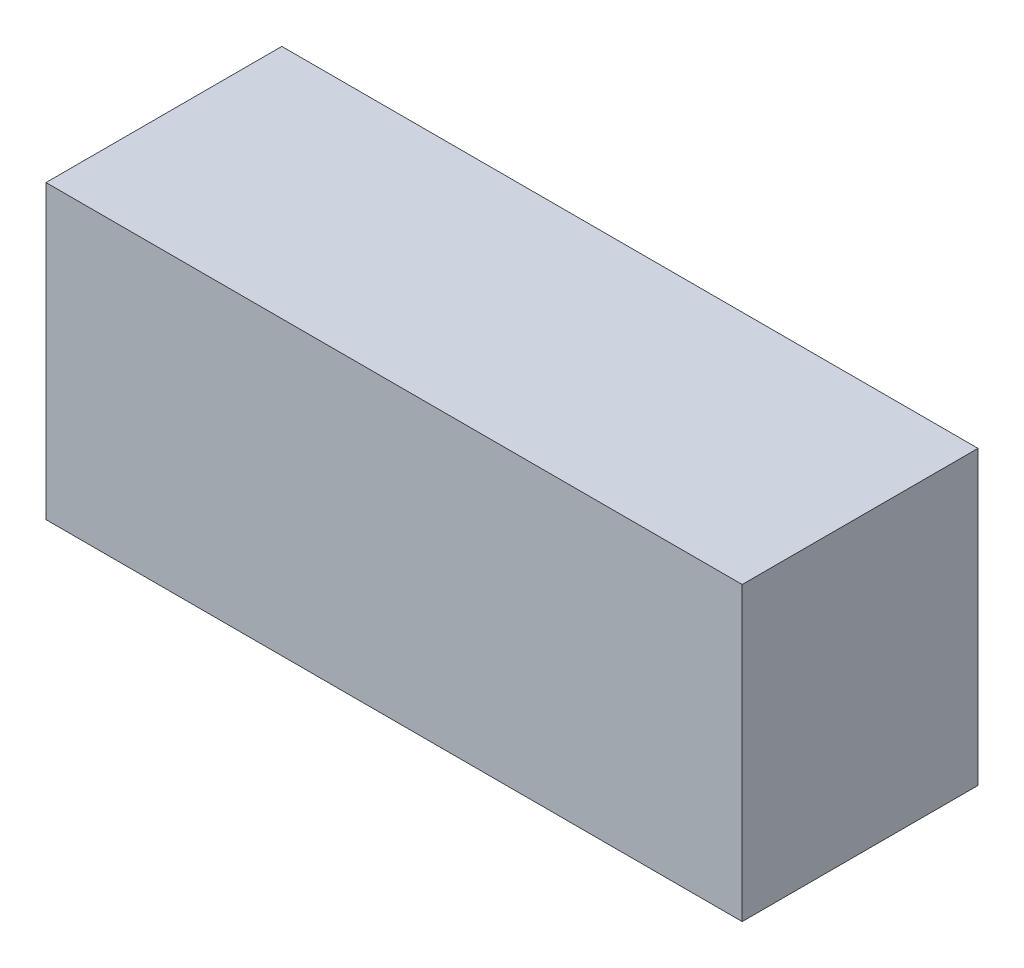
ISO-10303-21;
HEADER;
FILE_DESCRIPTION(('STEP AP214'),'2;1');
FILE_NAME('part.step','',(''),(''),'','','');
FILE_SCHEMA(('AUTOMOTIVE_DESIGN { 1 0 10303 214 1 1 1 1 }'));
ENDSEC;
DATA;
#1=APPLICATION_CONTEXT('core data for automotive mechanical design processes');
#2=APPLICATION_PROTOCOL_DEFINITION('international standard','automotive_design',2000,#1);
#3=PRODUCT_CONTEXT('',#1,'mechanical');
#4=PRODUCT('Part','Part','',(#3));
#5=PRODUCT_RELATED_PRODUCT_CATEGORY('part','',(#4));
#6=PRODUCT_DEFINITION_FORMATION('','',#4);
#7=PRODUCT_DEFINITION_CONTEXT('part definition',#1,'design');
#8=PRODUCT_DEFINITION('design','',#6,#7);
#9=PRODUCT_DEFINITION_SHAPE('','',#8);
#10=(LENGTH_UNIT() NAMED_UNIT(*) SI_UNIT(.MILLI.,.METRE.));
#11=(NAMED_UNIT(*) PLANE_ANGLE_UNIT() SI_UNIT($,.RADIAN.));
#12=(NAMED_UNIT(*) SI_UNIT($,.STERADIAN.) SOLID_ANGLE_UNIT());
#13=UNCERTAINTY_MEASURE_WITH_UNIT(LENGTH_MEASURE(1.E-05),#10,'distance_accuracy_value','');
#14=(GEOMETRIC_REPRESENTATION_CONTEXT(3) GLOBAL_UNCERTAINTY_ASSIGNED_CONTEXT((#13)) GLOBAL_UNIT_ASSIGNED_CONTEXT((#10,
#11,#12)) REPRESENTATION_CONTEXT('',''));
#15=CARTESIAN_POINT('',(0.,0.,0.));
#16=DIRECTION('',(0.,0.,1.));
#17=DIRECTION('',(1.,0.,0.));
#18=AXIS2_PLACEMENT_3D('',#15,#16,#17);
#19=CARTESIAN_POINT('',(3.874,-1.9,2.667));
#20=DIRECTION('',(0.,1.,0.));
#21=DIRECTION('',(0.,0.,1.));
#22=AXIS2_PLACEMENT_3D('',#19,#20,#21);
#23=PLANE('',#22);
#24=DIRECTION('',(1.,0.,0.));
#25=VECTOR('',#24,1.);
#26=CARTESIAN_POINT('',(3.874,-1.9,0.));
#27=LINE('',#26,#25);
#28=CARTESIAN_POINT('',(-4.,-1.9,0.));
#29=VERTEX_POINT('',#28);
#30=CARTESIAN_POINT('',(3.874,-1.9,0.));
#31=VERTEX_POINT('',#30);
#32=EDGE_CURVE('E95',#29,#31,#27,.T.);
#33=ORIENTED_EDGE('',*,*,#32,.T.);
#34=DIRECTION('',(0.,0.,-1.));
#35=VECTOR('',#34,1.);
#36=CARTESIAN_POINT('',(3.874,-1.9,2.667));
#37=LINE('',#36,#35);
#38=CARTESIAN_POINT('',(3.874,-1.9,2.667));
#39=VERTEX_POINT('',#38);
#40=EDGE_CURVE('E11',#39,#31,#37,.T.);
#41=ORIENTED_EDGE('',*,*,#40,.F.);
#42=DIRECTION('',(1.,0.,0.));
#43=VECTOR('',#42,1.);
#44=CARTESIAN_POINT('',(3.874,-1.9,2.667));
#45=LINE('',#44,#43);
#46=CARTESIAN_POINT('',(-4.,-1.9,2.667));
#47=VERTEX_POINT('',#46);
#48=EDGE_CURVE('E83',#47,#39,#45,.T.);
#49=ORIENTED_EDGE('',*,*,#48,.F.);
#50=DIRECTION('',(0.,0.,-1.));
#51=VECTOR('',#50,1.);
#52=CARTESIAN_POINT('',(-4.,-1.9,2.667));
#53=LINE('',#52,#51);
#54=EDGE_CURVE('E91',#47,#29,#53,.T.);
#55=ORIENTED_EDGE('',*,*,#54,.T.);
#56=EDGE_LOOP('',(#33,#41,#49,#55));
#57=FACE_BOUND('',#56,.T.);
#58=ADVANCED_FACE('F32',(#57),#23,.F.);
#59=CARTESIAN_POINT('',(3.874,1.402,2.667));
#60=DIRECTION('',(-1.,0.,0.));
#61=DIRECTION('',(0.,-1.,0.));
#62=AXIS2_PLACEMENT_3D('',#59,#60,#61);
#63=PLANE('',#62);
#64=DIRECTION('',(0.,1.,0.));
#65=VECTOR('',#64,1.);
#66=CARTESIAN_POINT('',(3.874,1.402,0.));
#67=LINE('',#66,#65);
#68=CARTESIAN_POINT('',(3.874,1.402,0.));
#69=VERTEX_POINT('',#68);
#70=EDGE_CURVE('E87',#31,#69,#67,.T.);
#71=ORIENTED_EDGE('',*,*,#70,.T.);
#72=DIRECTION('',(0.,0.,-1.));
#73=VECTOR('',#72,1.);
#74=CARTESIAN_POINT('',(3.874,1.402,2.667));
#75=LINE('',#74,#73);
#76=CARTESIAN_POINT('',(3.874,1.402,2.667));
#77=VERTEX_POINT('',#76);
#78=EDGE_CURVE('E40',#77,#69,#75,.T.);
#79=ORIENTED_EDGE('',*,*,#78,.F.);
#80=DIRECTION('',(0.,1.,0.));
#81=VECTOR('',#80,1.);
#82=CARTESIAN_POINT('',(3.874,1.402,2.667));
#83=LINE('',#82,#81);
#84=EDGE_CURVE('E78',#39,#77,#83,.T.);
#85=ORIENTED_EDGE('',*,*,#84,.F.);
#86=ORIENTED_EDGE('',*,*,#40,.T.);
#87=EDGE_LOOP('',(#71,#79,#85,#86));
#88=FACE_BOUND('',#87,.T.);
#89=ADVANCED_FACE('F86',(#88),#63,.F.);
#90=CARTESIAN_POINT('',(-4.,1.402,2.667));
#91=DIRECTION('',(0.,-1.,0.));
#92=DIRECTION('',(1.,0.,0.));
#93=AXIS2_PLACEMENT_3D('',#90,#91,#92);
#94=PLANE('',#93);
#95=DIRECTION('',(-1.,0.,0.));
#96=VECTOR('',#95,1.);
#97=CARTESIAN_POINT('',(-4.,1.402,0.));
#98=LINE('',#97,#96);
#99=CARTESIAN_POINT('',(-4.,1.402,0.));
#100=VERTEX_POINT('',#99);
#101=EDGE_CURVE('E65',#69,#100,#98,.T.);
#102=ORIENTED_EDGE('',*,*,#101,.T.);
#103=DIRECTION('',(0.,0.,-1.));
#104=VECTOR('',#103,1.);
#105=CARTESIAN_POINT('',(-4.,1.402,2.667));
#106=LINE('',#105,#104);
#107=CARTESIAN_POINT('',(-4.,1.402,2.667));
#108=VERTEX_POINT('',#107);
#109=EDGE_CURVE('E88',#108,#100,#106,.T.);
#110=ORIENTED_EDGE('',*,*,#109,.F.);
#111=DIRECTION('',(-1.,0.,0.));
#112=VECTOR('',#111,1.);
#113=CARTESIAN_POINT('',(-4.,1.402,2.667));
#114=LINE('',#113,#112);
#115=EDGE_CURVE('E81',#77,#108,#114,.T.);
#116=ORIENTED_EDGE('',*,*,#115,.F.);
#117=ORIENTED_EDGE('',*,*,#78,.T.);
#118=EDGE_LOOP('',(#102,#110,#116,#117));
#119=FACE_BOUND('',#118,.T.);
#120=ADVANCED_FACE('F89',(#119),#94,.F.);
#121=CARTESIAN_POINT('',(-4.,-1.9,2.667));
#122=DIRECTION('',(1.,0.,0.));
#123=DIRECTION('',(0.,0.,-1.));
#124=AXIS2_PLACEMENT_3D('',#121,#122,#123);
#125=PLANE('',#124);
#126=DIRECTION('',(0.,-1.,0.));
#127=VECTOR('',#126,1.);
#128=CARTESIAN_POINT('',(-4.,-1.9,0.));
#129=LINE('',#128,#127);
#130=EDGE_CURVE('E71',#100,#29,#129,.T.);
#131=ORIENTED_EDGE('',*,*,#130,.T.);
#132=ORIENTED_EDGE('',*,*,#54,.F.);
#133=DIRECTION('',(0.,-1.,0.));
#134=VECTOR('',#133,1.);
#135=CARTESIAN_POINT('',(-4.,-1.9,2.667));
#136=LINE('',#135,#134);
#137=EDGE_CURVE('E48',#108,#47,#136,.T.);
#138=ORIENTED_EDGE('',*,*,#137,.F.);
#139=ORIENTED_EDGE('',*,*,#109,.T.);
#140=EDGE_LOOP('',(#131,#132,#138,#139));
#141=FACE_BOUND('',#140,.T.);
#142=ADVANCED_FACE('F102',(#141),#125,.F.);
#143=CARTESIAN_POINT('',(0.,0.,2.667));
#144=DIRECTION('',(0.,0.,-1.));
#145=DIRECTION('',(-1.,0.,0.));
#146=AXIS2_PLACEMENT_3D('',#143,#144,#145);
#147=PLANE('',#146);
#148=ORIENTED_EDGE('',*,*,#48,.T.);
#149=ORIENTED_EDGE('',*,*,#84,.T.);
#150=ORIENTED_EDGE('',*,*,#115,.T.);
#151=ORIENTED_EDGE('',*,*,#137,.T.);
#152=EDGE_LOOP('',(#148,#149,#150,#151));
#153=FACE_BOUND('',#152,.T.);
#154=ADVANCED_FACE('F79',(#153),#147,.F.);
#155=CARTESIAN_POINT('',(0.,0.,0.));
#156=DIRECTION('',(0.,0.,-1.));
#157=DIRECTION('',(-1.,0.,0.));
#158=AXIS2_PLACEMENT_3D('',#155,#156,#157);
#159=PLANE('',#158);
#160=ORIENTED_EDGE('',*,*,#32,.F.);
#161=ORIENTED_EDGE('',*,*,#130,.F.);
#162=ORIENTED_EDGE('',*,*,#101,.F.);
#163=ORIENTED_EDGE('',*,*,#70,.F.);
#164=EDGE_LOOP('',(#160,#161,#162,#163));
#165=FACE_BOUND('',#164,.T.);
#166=ADVANCED_FACE('F105',(#165),#159,.T.);
#167=CLOSED_SHELL('',(#58,#89,#120,#142,#154,#166));
#168=MANIFOLD_SOLID_BREP('B2',#167);
#169=ADVANCED_BREP_SHAPE_REPRESENTATION('',(#18,#168),#14);
#170=SHAPE_DEFINITION_REPRESENTATION(#9,#169);
ENDSEC;
END-ISO-10303-21;
